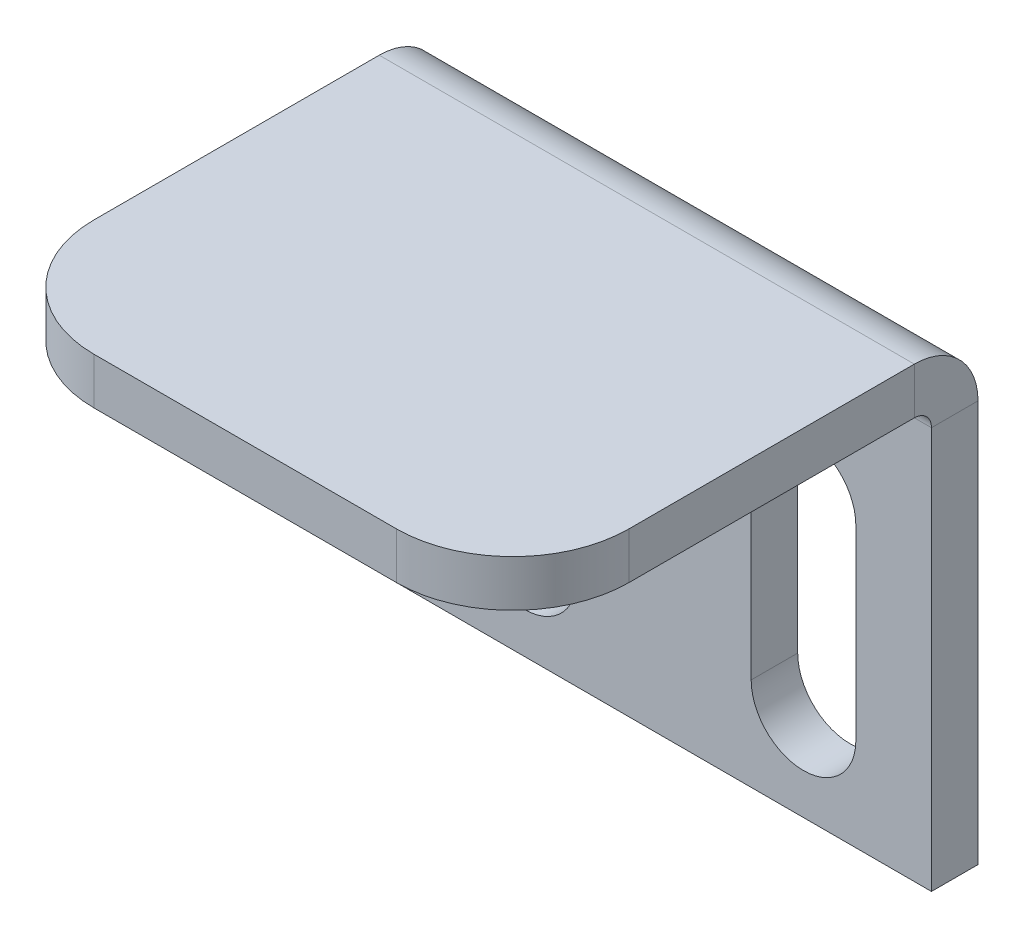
ISO-10303-21;
HEADER;
FILE_DESCRIPTION(('STEP AP214'),'2;1');
FILE_NAME('part.step','',(''),(''),'','','');
FILE_SCHEMA(('AUTOMOTIVE_DESIGN { 1 0 10303 214 1 1 1 1 }'));
ENDSEC;
DATA;
#1=APPLICATION_CONTEXT('core data for automotive mechanical design processes');
#2=APPLICATION_PROTOCOL_DEFINITION('international standard','automotive_design',2000,#1);
#3=PRODUCT_CONTEXT('',#1,'mechanical');
#4=PRODUCT('Part','Part','',(#3));
#5=PRODUCT_RELATED_PRODUCT_CATEGORY('part','',(#4));
#6=PRODUCT_DEFINITION_FORMATION('','',#4);
#7=PRODUCT_DEFINITION_CONTEXT('part definition',#1,'design');
#8=PRODUCT_DEFINITION('design','',#6,#7);
#9=PRODUCT_DEFINITION_SHAPE('','',#8);
#10=(LENGTH_UNIT() NAMED_UNIT(*) SI_UNIT(.MILLI.,.METRE.));
#11=(NAMED_UNIT(*) PLANE_ANGLE_UNIT() SI_UNIT($,.RADIAN.));
#12=(NAMED_UNIT(*) SI_UNIT($,.STERADIAN.) SOLID_ANGLE_UNIT());
#13=UNCERTAINTY_MEASURE_WITH_UNIT(LENGTH_MEASURE(1.E-05),#10,'distance_accuracy_value','');
#14=(GEOMETRIC_REPRESENTATION_CONTEXT(3) GLOBAL_UNCERTAINTY_ASSIGNED_CONTEXT((#13)) GLOBAL_UNIT_ASSIGNED_CONTEXT((#10,
#11,#12)) REPRESENTATION_CONTEXT('',''));
#15=CARTESIAN_POINT('',(0.,0.,0.));
#16=DIRECTION('',(0.,0.,1.));
#17=DIRECTION('',(1.,0.,0.));
#18=AXIS2_PLACEMENT_3D('',#15,#16,#17);
#19=CARTESIAN_POINT('',(-95.0000000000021,-1.16947700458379E-12,2.));
#20=DIRECTION('',(-1.,0.,0.));
#21=DIRECTION('',(0.,0.,1.));
#22=AXIS2_PLACEMENT_3D('',#19,#20,#21);
#23=PLANE('',#22);
#24=DIRECTION('',(0.,0.,-1.));
#25=VECTOR('',#24,1.);
#26=CARTESIAN_POINT('',(-95.0000000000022,-2.73660000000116,2.));
#27=LINE('',#26,#25);
#28=CARTESIAN_POINT('',(-95.0000000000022,-2.73660000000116,2.));
#29=VERTEX_POINT('',#28);
#30=CARTESIAN_POINT('',(-95.0000000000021,-2.73660000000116,0.));
#31=VERTEX_POINT('',#30);
#32=EDGE_CURVE('E259',#29,#31,#27,.T.);
#33=ORIENTED_EDGE('',*,*,#32,.F.);
#34=DIRECTION('',(0.,1.,0.));
#35=VECTOR('',#34,1.);
#36=CARTESIAN_POINT('',(-95.0000000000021,-1.16947700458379E-12,2.));
#37=LINE('',#36,#35);
#38=CARTESIAN_POINT('',(-95.0000000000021,-20.0000000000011,2.));
#39=VERTEX_POINT('',#38);
#40=EDGE_CURVE('E265',#39,#29,#37,.T.);
#41=ORIENTED_EDGE('',*,*,#40,.F.);
#42=DIRECTION('',(0.,0.,-1.));
#43=VECTOR('',#42,1.);
#44=CARTESIAN_POINT('',(-95.0000000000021,-20.0000000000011,2.));
#45=LINE('',#44,#43);
#46=CARTESIAN_POINT('',(-95.0000000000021,-20.0000000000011,0.));
#47=VERTEX_POINT('',#46);
#48=EDGE_CURVE('E273',#39,#47,#45,.T.);
#49=ORIENTED_EDGE('',*,*,#48,.T.);
#50=DIRECTION('',(0.,1.,0.));
#51=VECTOR('',#50,1.);
#52=CARTESIAN_POINT('',(-95.0000000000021,-1.16947700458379E-12,0.));
#53=LINE('',#52,#51);
#54=EDGE_CURVE('E262',#47,#31,#53,.T.);
#55=ORIENTED_EDGE('',*,*,#54,.T.);
#56=EDGE_LOOP('',(#33,#41,#49,#55));
#57=FACE_BOUND('',#56,.T.);
#58=ADVANCED_FACE('F16',(#57),#23,.F.);
#59=CARTESIAN_POINT('',(-118.,0.,2.));
#60=DIRECTION('',(1.,0.,0.));
#61=DIRECTION('',(0.,0.,-1.));
#62=AXIS2_PLACEMENT_3D('',#59,#60,#61);
#63=PLANE('',#62);
#64=DIRECTION('',(0.,0.,-1.));
#65=VECTOR('',#64,1.);
#66=CARTESIAN_POINT('',(-118.,-2.7366,2.));
#67=LINE('',#66,#65);
#68=CARTESIAN_POINT('',(-118.,-2.7366,2.));
#69=VERTEX_POINT('',#68);
#70=CARTESIAN_POINT('',(-118.,-2.7366,0.));
#71=VERTEX_POINT('',#70);
#72=EDGE_CURVE('E249',#69,#71,#67,.T.);
#73=ORIENTED_EDGE('',*,*,#72,.T.);
#74=DIRECTION('',(0.,-1.,0.));
#75=VECTOR('',#74,1.);
#76=CARTESIAN_POINT('',(-118.,0.,0.));
#77=LINE('',#76,#75);
#78=CARTESIAN_POINT('',(-118.,-20.0000000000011,0.));
#79=VERTEX_POINT('',#78);
#80=EDGE_CURVE('E276',#71,#79,#77,.T.);
#81=ORIENTED_EDGE('',*,*,#80,.T.);
#82=DIRECTION('',(0.,0.,-1.));
#83=VECTOR('',#82,1.);
#84=CARTESIAN_POINT('',(-118.,-20.0000000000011,2.));
#85=LINE('',#84,#83);
#86=CARTESIAN_POINT('',(-118.,-20.0000000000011,2.));
#87=VERTEX_POINT('',#86);
#88=EDGE_CURVE('E281',#87,#79,#85,.T.);
#89=ORIENTED_EDGE('',*,*,#88,.F.);
#90=DIRECTION('',(0.,-1.,0.));
#91=VECTOR('',#90,1.);
#92=CARTESIAN_POINT('',(-118.,0.,2.));
#93=LINE('',#92,#91);
#94=EDGE_CURVE('E268',#69,#87,#93,.T.);
#95=ORIENTED_EDGE('',*,*,#94,.F.);
#96=EDGE_LOOP('',(#73,#81,#89,#95));
#97=FACE_BOUND('',#96,.T.);
#98=ADVANCED_FACE('F341',(#97),#63,.F.);
#99=CARTESIAN_POINT('',(0.,0.,2.));
#100=DIRECTION('',(0.,0.,-1.));
#101=DIRECTION('',(-1.,0.,0.));
#102=AXIS2_PLACEMENT_3D('',#99,#100,#101);
#103=PLANE('',#102);
#104=DIRECTION('',(0.,1.,0.));
#105=VECTOR('',#104,1.);
#106=CARTESIAN_POINT('',(-98.2500000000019,-16.0000000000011,2.));
#107=LINE('',#106,#105);
#108=CARTESIAN_POINT('',(-98.2500000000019,-16.0000000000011,2.));
#109=VERTEX_POINT('',#108);
#110=CARTESIAN_POINT('',(-98.2500000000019,-8.00000000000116,2.));
#111=VERTEX_POINT('',#110);
#112=EDGE_CURVE('E177',#109,#111,#107,.T.);
#113=ORIENTED_EDGE('',*,*,#112,.F.);
#114=CARTESIAN_POINT('',(-100.500000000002,-16.0000000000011,2.));
#115=DIRECTION('',(0.,0.,1.));
#116=DIRECTION('',(-1.,0.,0.));
#117=AXIS2_PLACEMENT_3D('',#114,#115,#116);
#118=CIRCLE('',#117,2.25);
#119=CARTESIAN_POINT('',(-102.750000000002,-16.0000000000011,2.));
#120=VERTEX_POINT('',#119);
#121=EDGE_CURVE('E150',#120,#109,#118,.T.);
#122=ORIENTED_EDGE('',*,*,#121,.F.);
#123=DIRECTION('',(0.,-1.,0.));
#124=VECTOR('',#123,1.);
#125=CARTESIAN_POINT('',(-102.750000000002,-16.0000000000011,2.));
#126=LINE('',#125,#124);
#127=CARTESIAN_POINT('',(-102.750000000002,-8.00000000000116,2.));
#128=VERTEX_POINT('',#127);
#129=EDGE_CURVE('E168',#128,#120,#126,.T.);
#130=ORIENTED_EDGE('',*,*,#129,.F.);
#131=CARTESIAN_POINT('',(-100.500000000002,-8.00000000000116,2.));
#132=DIRECTION('',(0.,0.,1.));
#133=DIRECTION('',(-1.,0.,0.));
#134=AXIS2_PLACEMENT_3D('',#131,#132,#133);
#135=CIRCLE('',#134,2.25);
#136=EDGE_CURVE('E171',#111,#128,#135,.T.);
#137=ORIENTED_EDGE('',*,*,#136,.F.);
#138=EDGE_LOOP('',(#113,#122,#130,#137));
#139=FACE_BOUND('',#138,.T.);
#140=DIRECTION('',(0.,1.,0.));
#141=VECTOR('',#140,1.);
#142=CARTESIAN_POINT('',(-110.25,-16.0000000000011,2.));
#143=LINE('',#142,#141);
#144=CARTESIAN_POINT('',(-110.25,-16.0000000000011,2.));
#145=VERTEX_POINT('',#144);
#146=CARTESIAN_POINT('',(-110.25,-8.00000000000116,2.));
#147=VERTEX_POINT('',#146);
#148=EDGE_CURVE('E202',#145,#147,#143,.T.);
#149=ORIENTED_EDGE('',*,*,#148,.F.);
#150=CARTESIAN_POINT('',(-112.5,-16.0000000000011,2.));
#151=DIRECTION('',(0.,0.,1.));
#152=DIRECTION('',(1.,0.,0.));
#153=AXIS2_PLACEMENT_3D('',#150,#151,#152);
#154=CIRCLE('',#153,2.25);
#155=CARTESIAN_POINT('',(-114.75,-16.0000000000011,2.));
#156=VERTEX_POINT('',#155);
#157=EDGE_CURVE('E183',#156,#145,#154,.T.);
#158=ORIENTED_EDGE('',*,*,#157,.F.);
#159=DIRECTION('',(0.,-1.,0.));
#160=VECTOR('',#159,1.);
#161=CARTESIAN_POINT('',(-114.75,-16.0000000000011,2.));
#162=LINE('',#161,#160);
#163=CARTESIAN_POINT('',(-114.75,-8.00000000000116,2.));
#164=VERTEX_POINT('',#163);
#165=EDGE_CURVE('E191',#164,#156,#162,.T.);
#166=ORIENTED_EDGE('',*,*,#165,.F.);
#167=CARTESIAN_POINT('',(-112.5,-8.00000000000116,2.));
#168=DIRECTION('',(0.,0.,1.));
#169=DIRECTION('',(1.,0.,0.));
#170=AXIS2_PLACEMENT_3D('',#167,#168,#169);
#171=CIRCLE('',#170,2.25);
#172=EDGE_CURVE('E205',#147,#164,#171,.T.);
#173=ORIENTED_EDGE('',*,*,#172,.F.);
#174=EDGE_LOOP('',(#149,#158,#166,#173));
#175=FACE_BOUND('',#174,.T.);
#176=DIRECTION('',(-1.,0.,0.));
#177=VECTOR('',#176,1.);
#178=CARTESIAN_POINT('',(-118.,-2.7366,2.));
#179=LINE('',#178,#177);
#180=EDGE_CURVE('E255',#69,#29,#179,.F.);
#181=ORIENTED_EDGE('',*,*,#180,.F.);
#182=ORIENTED_EDGE('',*,*,#94,.T.);
#183=DIRECTION('',(1.,0.,0.));
#184=VECTOR('',#183,1.);
#185=CARTESIAN_POINT('',(-95.0000000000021,-20.0000000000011,2.));
#186=LINE('',#185,#184);
#187=EDGE_CURVE('E271',#87,#39,#186,.T.);
#188=ORIENTED_EDGE('',*,*,#187,.T.);
#189=ORIENTED_EDGE('',*,*,#40,.T.);
#190=EDGE_LOOP('',(#181,#182,#188,#189));
#191=FACE_BOUND('',#190,.T.);
#192=ADVANCED_FACE('F346',(#139,#175,#191),#103,.F.);
#193=CARTESIAN_POINT('',(0.,0.,0.));
#194=DIRECTION('',(0.,0.,-1.));
#195=DIRECTION('',(-1.,0.,0.));
#196=AXIS2_PLACEMENT_3D('',#193,#194,#195);
#197=PLANE('',#196);
#198=CARTESIAN_POINT('',(-100.500000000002,-16.0000000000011,0.));
#199=DIRECTION('',(0.,0.,1.));
#200=DIRECTION('',(-1.,0.,0.));
#201=AXIS2_PLACEMENT_3D('',#198,#199,#200);
#202=CIRCLE('',#201,2.25);
#203=CARTESIAN_POINT('',(-102.750000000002,-16.0000000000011,0.));
#204=VERTEX_POINT('',#203);
#205=CARTESIAN_POINT('',(-98.2500000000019,-16.0000000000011,0.));
#206=VERTEX_POINT('',#205);
#207=EDGE_CURVE('E147',#204,#206,#202,.T.);
#208=ORIENTED_EDGE('',*,*,#207,.T.);
#209=DIRECTION('',(0.,1.,0.));
#210=VECTOR('',#209,1.);
#211=CARTESIAN_POINT('',(-98.2500000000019,-16.0000000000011,0.));
#212=LINE('',#211,#210);
#213=CARTESIAN_POINT('',(-98.2500000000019,-8.00000000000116,0.));
#214=VERTEX_POINT('',#213);
#215=EDGE_CURVE('E159',#206,#214,#212,.T.);
#216=ORIENTED_EDGE('',*,*,#215,.T.);
#217=CARTESIAN_POINT('',(-100.500000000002,-8.00000000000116,0.));
#218=DIRECTION('',(0.,0.,1.));
#219=DIRECTION('',(-1.,0.,0.));
#220=AXIS2_PLACEMENT_3D('',#217,#218,#219);
#221=CIRCLE('',#220,2.25);
#222=CARTESIAN_POINT('',(-102.750000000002,-8.00000000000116,0.));
#223=VERTEX_POINT('',#222);
#224=EDGE_CURVE('E163',#214,#223,#221,.T.);
#225=ORIENTED_EDGE('',*,*,#224,.T.);
#226=DIRECTION('',(0.,-1.,0.));
#227=VECTOR('',#226,1.);
#228=CARTESIAN_POINT('',(-102.750000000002,-16.0000000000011,0.));
#229=LINE('',#228,#227);
#230=EDGE_CURVE('E155',#223,#204,#229,.T.);
#231=ORIENTED_EDGE('',*,*,#230,.T.);
#232=EDGE_LOOP('',(#208,#216,#225,#231));
#233=FACE_BOUND('',#232,.T.);
#234=CARTESIAN_POINT('',(-112.5,-16.0000000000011,0.));
#235=DIRECTION('',(0.,0.,1.));
#236=DIRECTION('',(1.,0.,0.));
#237=AXIS2_PLACEMENT_3D('',#234,#235,#236);
#238=CIRCLE('',#237,2.25);
#239=CARTESIAN_POINT('',(-114.75,-16.0000000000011,0.));
#240=VERTEX_POINT('',#239);
#241=CARTESIAN_POINT('',(-110.25,-16.0000000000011,0.));
#242=VERTEX_POINT('',#241);
#243=EDGE_CURVE('E187',#240,#242,#238,.T.);
#244=ORIENTED_EDGE('',*,*,#243,.T.);
#245=DIRECTION('',(0.,1.,0.));
#246=VECTOR('',#245,1.);
#247=CARTESIAN_POINT('',(-110.25,-16.0000000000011,0.));
#248=LINE('',#247,#246);
#249=CARTESIAN_POINT('',(-110.25,-8.00000000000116,0.));
#250=VERTEX_POINT('',#249);
#251=EDGE_CURVE('E190',#242,#250,#248,.T.);
#252=ORIENTED_EDGE('',*,*,#251,.T.);
#253=CARTESIAN_POINT('',(-112.5,-8.00000000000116,0.));
#254=DIRECTION('',(0.,0.,1.));
#255=DIRECTION('',(1.,0.,0.));
#256=AXIS2_PLACEMENT_3D('',#253,#254,#255);
#257=CIRCLE('',#256,2.25);
#258=CARTESIAN_POINT('',(-114.75,-8.00000000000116,0.));
#259=VERTEX_POINT('',#258);
#260=EDGE_CURVE('E194',#250,#259,#257,.T.);
#261=ORIENTED_EDGE('',*,*,#260,.T.);
#262=DIRECTION('',(0.,-1.,0.));
#263=VECTOR('',#262,1.);
#264=CARTESIAN_POINT('',(-114.75,-16.0000000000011,0.));
#265=LINE('',#264,#263);
#266=EDGE_CURVE('E197',#259,#240,#265,.T.);
#267=ORIENTED_EDGE('',*,*,#266,.T.);
#268=EDGE_LOOP('',(#244,#252,#261,#267));
#269=FACE_BOUND('',#268,.T.);
#270=ORIENTED_EDGE('',*,*,#80,.F.);
#271=DIRECTION('',(-1.,0.,0.));
#272=VECTOR('',#271,1.);
#273=CARTESIAN_POINT('',(-118.,-2.7366,0.));
#274=LINE('',#273,#272);
#275=EDGE_CURVE('E242',#71,#31,#274,.F.);
#276=ORIENTED_EDGE('',*,*,#275,.T.);
#277=ORIENTED_EDGE('',*,*,#54,.F.);
#278=DIRECTION('',(1.,0.,0.));
#279=VECTOR('',#278,1.);
#280=CARTESIAN_POINT('',(-95.0000000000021,-20.0000000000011,0.));
#281=LINE('',#280,#279);
#282=EDGE_CURVE('E269',#79,#47,#281,.T.);
#283=ORIENTED_EDGE('',*,*,#282,.F.);
#284=EDGE_LOOP('',(#270,#276,#277,#283));
#285=FACE_BOUND('',#284,.T.);
#286=ADVANCED_FACE('F165',(#233,#269,#285),#197,.T.);
#287=CARTESIAN_POINT('',(-95.0000000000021,-20.0000000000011,2.));
#288=DIRECTION('',(0.,1.,0.));
#289=DIRECTION('',(-1.,0.,0.));
#290=AXIS2_PLACEMENT_3D('',#287,#288,#289);
#291=PLANE('',#290);
#292=ORIENTED_EDGE('',*,*,#282,.T.);
#293=ORIENTED_EDGE('',*,*,#48,.F.);
#294=ORIENTED_EDGE('',*,*,#187,.F.);
#295=ORIENTED_EDGE('',*,*,#88,.T.);
#296=EDGE_LOOP('',(#292,#293,#294,#295));
#297=FACE_BOUND('',#296,.T.);
#298=ADVANCED_FACE('F337',(#297),#291,.F.);
#299=CARTESIAN_POINT('',(-95.0000000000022,-2.73660000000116,2.7366));
#300=DIRECTION('',(1.,0.,0.));
#301=DIRECTION('',(0.,1.,0.));
#302=AXIS2_PLACEMENT_3D('',#299,#300,#301);
#303=PLANE('',#302);
#304=DIRECTION('',(0.,-1.,0.));
#305=VECTOR('',#304,1.);
#306=CARTESIAN_POINT('',(-95.0000000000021,-1.16706547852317E-12,2.7366));
#307=LINE('',#306,#305);
#308=CARTESIAN_POINT('',(-95.0000000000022,-2.00000000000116,2.7366));
#309=VERTEX_POINT('',#308);
#310=CARTESIAN_POINT('',(-95.0000000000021,-1.1666015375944E-12,2.7366));
#311=VERTEX_POINT('',#310);
#312=EDGE_CURVE('E212',#309,#311,#307,.F.);
#313=ORIENTED_EDGE('',*,*,#312,.F.);
#314=CARTESIAN_POINT('',(-95.0000000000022,-2.73660000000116,2.7366));
#315=DIRECTION('',(-1.,0.,0.));
#316=DIRECTION('',(0.,-1.,0.));
#317=AXIS2_PLACEMENT_3D('',#314,#315,#316);
#318=CIRCLE('',#317,0.7366);
#319=EDGE_CURVE('E252',#29,#309,#318,.F.);
#320=ORIENTED_EDGE('',*,*,#319,.F.);
#321=ORIENTED_EDGE('',*,*,#32,.T.);
#322=CARTESIAN_POINT('',(-95.0000000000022,-2.73660000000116,2.7366));
#323=DIRECTION('',(-1.,0.,0.));
#324=DIRECTION('',(0.,-1.,0.));
#325=AXIS2_PLACEMENT_3D('',#322,#323,#324);
#326=CIRCLE('',#325,2.7366);
#327=EDGE_CURVE('E245',#31,#311,#326,.F.);
#328=ORIENTED_EDGE('',*,*,#327,.T.);
#329=EDGE_LOOP('',(#313,#320,#321,#328));
#330=FACE_BOUND('',#329,.T.);
#331=ADVANCED_FACE('F325',(#330),#303,.T.);
#332=CARTESIAN_POINT('',(-118.,-2.7366,2.7366));
#333=DIRECTION('',(1.,0.,0.));
#334=DIRECTION('',(0.,1.,0.));
#335=AXIS2_PLACEMENT_3D('',#332,#333,#334);
#336=PLANE('',#335);
#337=CARTESIAN_POINT('',(-118.,-2.7366,2.7366));
#338=DIRECTION('',(-1.,0.,0.));
#339=DIRECTION('',(0.,-1.,0.));
#340=AXIS2_PLACEMENT_3D('',#337,#338,#339);
#341=CIRCLE('',#340,0.7366);
#342=CARTESIAN_POINT('',(-118.,-2.,2.7366));
#343=VERTEX_POINT('',#342);
#344=EDGE_CURVE('E221',#343,#69,#341,.T.);
#345=ORIENTED_EDGE('',*,*,#344,.F.);
#346=DIRECTION('',(0.,-1.,0.));
#347=VECTOR('',#346,1.);
#348=CARTESIAN_POINT('',(-118.,-2.,2.7366));
#349=LINE('',#348,#347);
#350=CARTESIAN_POINT('',(-118.,0.,2.7366));
#351=VERTEX_POINT('',#350);
#352=EDGE_CURVE('E235',#343,#351,#349,.F.);
#353=ORIENTED_EDGE('',*,*,#352,.T.);
#354=CARTESIAN_POINT('',(-118.,-2.7366,2.7366));
#355=DIRECTION('',(-1.,0.,0.));
#356=DIRECTION('',(0.,-1.,0.));
#357=AXIS2_PLACEMENT_3D('',#354,#355,#356);
#358=CIRCLE('',#357,2.7366);
#359=EDGE_CURVE('E246',#351,#71,#358,.T.);
#360=ORIENTED_EDGE('',*,*,#359,.T.);
#361=ORIENTED_EDGE('',*,*,#72,.F.);
#362=EDGE_LOOP('',(#345,#353,#360,#361));
#363=FACE_BOUND('',#362,.T.);
#364=ADVANCED_FACE('F321',(#363),#336,.F.);
#365=CARTESIAN_POINT('',(-118.,-2.7366,2.7366));
#366=DIRECTION('',(-1.,0.,0.));
#367=DIRECTION('',(0.,1.,0.));
#368=AXIS2_PLACEMENT_3D('',#365,#366,#367);
#369=CYLINDRICAL_SURFACE('',#368,2.7366);
#370=ORIENTED_EDGE('',*,*,#275,.F.);
#371=ORIENTED_EDGE('',*,*,#359,.F.);
#372=DIRECTION('',(-1.,0.,0.));
#373=VECTOR('',#372,1.);
#374=CARTESIAN_POINT('',(-95.0000000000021,-1.1670352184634E-12,2.7366));
#375=LINE('',#374,#373);
#376=EDGE_CURVE('E232',#351,#311,#375,.F.);
#377=ORIENTED_EDGE('',*,*,#376,.T.);
#378=ORIENTED_EDGE('',*,*,#327,.F.);
#379=EDGE_LOOP('',(#370,#371,#377,#378));
#380=FACE_BOUND('',#379,.T.);
#381=ADVANCED_FACE('F323',(#380),#369,.T.);
#382=CARTESIAN_POINT('',(-118.,-2.7366,2.7366));
#383=DIRECTION('',(-1.,0.,0.));
#384=DIRECTION('',(0.,1.,0.));
#385=AXIS2_PLACEMENT_3D('',#382,#383,#384);
#386=CYLINDRICAL_SURFACE('',#385,0.7366);
#387=ORIENTED_EDGE('',*,*,#180,.T.);
#388=ORIENTED_EDGE('',*,*,#319,.T.);
#389=DIRECTION('',(-1.,0.,0.));
#390=VECTOR('',#389,1.);
#391=CARTESIAN_POINT('',(-95.0000000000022,-2.00000000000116,2.7366));
#392=LINE('',#391,#390);
#393=EDGE_CURVE('E238',#309,#343,#392,.T.);
#394=ORIENTED_EDGE('',*,*,#393,.T.);
#395=ORIENTED_EDGE('',*,*,#344,.T.);
#396=EDGE_LOOP('',(#387,#388,#394,#395));
#397=FACE_BOUND('',#396,.T.);
#398=ADVANCED_FACE('F344',(#397),#386,.F.);
#399=CARTESIAN_POINT('',(-118.,0.,20.));
#400=DIRECTION('',(1.,0.,0.));
#401=DIRECTION('',(0.,1.,0.));
#402=AXIS2_PLACEMENT_3D('',#399,#400,#401);
#403=PLANE('',#402);
#404=DIRECTION('',(0.,0.,-1.));
#405=VECTOR('',#404,1.);
#406=CARTESIAN_POINT('',(-118.,-1.99999999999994,20.));
#407=LINE('',#406,#405);
#408=CARTESIAN_POINT('',(-118.,-1.99999999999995,15.));
#409=VERTEX_POINT('',#408);
#410=EDGE_CURVE('E230',#343,#409,#407,.F.);
#411=ORIENTED_EDGE('',*,*,#410,.T.);
#412=DIRECTION('',(0.,-1.,0.));
#413=VECTOR('',#412,1.);
#414=CARTESIAN_POINT('',(-118.,0.,15.));
#415=LINE('',#414,#413);
#416=CARTESIAN_POINT('',(-118.,0.,15.));
#417=VERTEX_POINT('',#416);
#418=EDGE_CURVE('E11',#409,#417,#415,.F.);
#419=ORIENTED_EDGE('',*,*,#418,.T.);
#420=DIRECTION('',(0.,0.,1.));
#421=VECTOR('',#420,1.);
#422=CARTESIAN_POINT('',(-118.,0.,0.));
#423=LINE('',#422,#421);
#424=EDGE_CURVE('E224',#351,#417,#423,.T.);
#425=ORIENTED_EDGE('',*,*,#424,.F.);
#426=ORIENTED_EDGE('',*,*,#352,.F.);
#427=EDGE_LOOP('',(#411,#419,#425,#426));
#428=FACE_BOUND('',#427,.T.);
#429=ADVANCED_FACE('F318',(#428),#403,.F.);
#430=CARTESIAN_POINT('',(-95.0000000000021,-1.16963730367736E-12,2.));
#431=DIRECTION('',(-1.,0.,0.));
#432=DIRECTION('',(0.,-1.,0.));
#433=AXIS2_PLACEMENT_3D('',#430,#431,#432);
#434=PLANE('',#433);
#435=DIRECTION('',(0.,0.,-1.));
#436=VECTOR('',#435,1.);
#437=CARTESIAN_POINT('',(-95.0000000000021,-1.17638998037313E-12,0.));
#438=LINE('',#437,#436);
#439=CARTESIAN_POINT('',(-95.0000000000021,-1.12401776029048E-12,15.));
#440=VERTEX_POINT('',#439);
#441=EDGE_CURVE('E219',#440,#311,#438,.T.);
#442=ORIENTED_EDGE('',*,*,#441,.F.);
#443=DIRECTION('',(0.,-1.,0.));
#444=VECTOR('',#443,1.);
#445=CARTESIAN_POINT('',(-95.0000000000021,-1.1242480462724E-12,15.));
#446=LINE('',#445,#444);
#447=CARTESIAN_POINT('',(-95.0000000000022,-2.00000000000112,15.));
#448=VERTEX_POINT('',#447);
#449=EDGE_CURVE('E284',#440,#448,#446,.T.);
#450=ORIENTED_EDGE('',*,*,#449,.T.);
#451=DIRECTION('',(0.,0.,1.));
#452=VECTOR('',#451,1.);
#453=CARTESIAN_POINT('',(-95.0000000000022,-2.00000000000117,2.));
#454=LINE('',#453,#452);
#455=EDGE_CURVE('E226',#448,#309,#454,.F.);
#456=ORIENTED_EDGE('',*,*,#455,.T.);
#457=ORIENTED_EDGE('',*,*,#312,.T.);
#458=EDGE_LOOP('',(#442,#450,#456,#457));
#459=FACE_BOUND('',#458,.T.);
#460=ADVANCED_FACE('F304',(#459),#434,.F.);
#461=CARTESIAN_POINT('',(0.,-5.99520433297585E-12,0.));
#462=DIRECTION('',(0.,-1.,0.));
#463=DIRECTION('',(1.,0.,0.));
#464=AXIS2_PLACEMENT_3D('',#461,#462,#463);
#465=PLANE('',#464);
#466=DIRECTION('',(1.,0.,0.));
#467=VECTOR('',#466,1.);
#468=CARTESIAN_POINT('',(0.,-5.92537470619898E-12,20.));
#469=LINE('',#468,#467);
#470=CARTESIAN_POINT('',(-113.,-1.93521844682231E-13,20.));
#471=VERTEX_POINT('',#470);
#472=CARTESIAN_POINT('',(-100.000000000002,-8.52938545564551E-13,20.));
#473=VERTEX_POINT('',#472);
#474=EDGE_CURVE('E222',#471,#473,#469,.T.);
#475=ORIENTED_EDGE('',*,*,#474,.T.);
#476=CARTESIAN_POINT('',(-100.000000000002,-8.70395952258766E-13,15.));
#477=DIRECTION('',(0.,-1.,0.));
#478=DIRECTION('',(1.,0.,0.));
#479=AXIS2_PLACEMENT_3D('',#476,#477,#478);
#480=CIRCLE('',#479,5.);
#481=EDGE_CURVE('E24',#473,#440,#480,.F.);
#482=ORIENTED_EDGE('',*,*,#481,.T.);
#483=ORIENTED_EDGE('',*,*,#441,.T.);
#484=ORIENTED_EDGE('',*,*,#376,.F.);
#485=ORIENTED_EDGE('',*,*,#424,.T.);
#486=CARTESIAN_POINT('',(-113.,-2.10979251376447E-13,15.));
#487=DIRECTION('',(0.,-1.,0.));
#488=DIRECTION('',(1.,0.,0.));
#489=AXIS2_PLACEMENT_3D('',#486,#487,#488);
#490=CIRCLE('',#489,5.);
#491=EDGE_CURVE('E295',#417,#471,#490,.F.);
#492=ORIENTED_EDGE('',*,*,#491,.T.);
#493=EDGE_LOOP('',(#475,#482,#483,#484,#485,#492));
#494=FACE_BOUND('',#493,.T.);
#495=ADVANCED_FACE('F299',(#494),#465,.F.);
#496=CARTESIAN_POINT('',(-1.01448723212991E-13,-2.000000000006,0.));
#497=DIRECTION('',(0.,-1.,0.));
#498=DIRECTION('',(1.,0.,0.));
#499=AXIS2_PLACEMENT_3D('',#496,#497,#498);
#500=PLANE('',#499);
#501=ORIENTED_EDGE('',*,*,#455,.F.);
#502=CARTESIAN_POINT('',(-100.000000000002,-2.00000000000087,15.));
#503=DIRECTION('',(0.,-1.,0.));
#504=DIRECTION('',(1.,0.,0.));
#505=AXIS2_PLACEMENT_3D('',#502,#503,#504);
#506=CIRCLE('',#505,5.);
#507=CARTESIAN_POINT('',(-100.000000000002,-2.00000000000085,20.));
#508=VERTEX_POINT('',#507);
#509=EDGE_CURVE('E289',#448,#508,#506,.T.);
#510=ORIENTED_EDGE('',*,*,#509,.T.);
#511=DIRECTION('',(-1.,0.,0.));
#512=VECTOR('',#511,1.);
#513=CARTESIAN_POINT('',(-95.0000000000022,-2.0000000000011,20.));
#514=LINE('',#513,#512);
#515=CARTESIAN_POINT('',(-113.,-2.0000000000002,20.));
#516=VERTEX_POINT('',#515);
#517=EDGE_CURVE('E228',#516,#508,#514,.F.);
#518=ORIENTED_EDGE('',*,*,#517,.F.);
#519=CARTESIAN_POINT('',(-113.,-2.00000000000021,15.));
#520=DIRECTION('',(0.,-1.,0.));
#521=DIRECTION('',(1.,0.,0.));
#522=AXIS2_PLACEMENT_3D('',#519,#520,#521);
#523=CIRCLE('',#522,5.);
#524=EDGE_CURVE('E287',#516,#409,#523,.T.);
#525=ORIENTED_EDGE('',*,*,#524,.T.);
#526=ORIENTED_EDGE('',*,*,#410,.F.);
#527=ORIENTED_EDGE('',*,*,#393,.F.);
#528=EDGE_LOOP('',(#501,#510,#518,#525,#526,#527));
#529=FACE_BOUND('',#528,.T.);
#530=ADVANCED_FACE('F310',(#529),#500,.T.);
#531=CARTESIAN_POINT('',(-95.0000000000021,-1.1067535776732E-12,20.));
#532=DIRECTION('',(0.,0.,-1.));
#533=DIRECTION('',(0.,1.,0.));
#534=AXIS2_PLACEMENT_3D('',#531,#532,#533);
#535=PLANE('',#534);
#536=ORIENTED_EDGE('',*,*,#517,.T.);
#537=DIRECTION('',(0.,-1.,0.));
#538=VECTOR('',#537,1.);
#539=CARTESIAN_POINT('',(-100.000000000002,-8.53131769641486E-13,20.));
#540=LINE('',#539,#538);
#541=EDGE_CURVE('E37',#508,#473,#540,.F.);
#542=ORIENTED_EDGE('',*,*,#541,.T.);
#543=ORIENTED_EDGE('',*,*,#474,.F.);
#544=DIRECTION('',(0.,-1.,0.));
#545=VECTOR('',#544,1.);
#546=CARTESIAN_POINT('',(-113.,-1.93715068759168E-13,20.));
#547=LINE('',#546,#545);
#548=EDGE_CURVE('E291',#471,#516,#547,.T.);
#549=ORIENTED_EDGE('',*,*,#548,.T.);
#550=EDGE_LOOP('',(#536,#542,#543,#549));
#551=FACE_BOUND('',#550,.T.);
#552=ADVANCED_FACE('F312',(#551),#535,.F.);
#553=CARTESIAN_POINT('',(-112.5,-16.0000000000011,0.));
#554=DIRECTION('',(0.,0.,1.));
#555=DIRECTION('',(1.,0.,0.));
#556=AXIS2_PLACEMENT_3D('',#553,#554,#555);
#557=CYLINDRICAL_SURFACE('',#556,2.25);
#558=ORIENTED_EDGE('',*,*,#157,.T.);
#559=DIRECTION('',(0.,0.,1.));
#560=VECTOR('',#559,1.);
#561=CARTESIAN_POINT('',(-110.25,-16.0000000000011,0.));
#562=LINE('',#561,#560);
#563=EDGE_CURVE('E200',#242,#145,#562,.T.);
#564=ORIENTED_EDGE('',*,*,#563,.F.);
#565=ORIENTED_EDGE('',*,*,#243,.F.);
#566=DIRECTION('',(0.,0.,1.));
#567=VECTOR('',#566,1.);
#568=CARTESIAN_POINT('',(-114.75,-16.0000000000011,0.));
#569=LINE('',#568,#567);
#570=EDGE_CURVE('E210',#240,#156,#569,.T.);
#571=ORIENTED_EDGE('',*,*,#570,.T.);
#572=EDGE_LOOP('',(#558,#564,#565,#571));
#573=FACE_BOUND('',#572,.T.);
#574=ADVANCED_FACE('F390',(#573),#557,.F.);
#575=CARTESIAN_POINT('',(-114.75,-16.0000000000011,0.));
#576=DIRECTION('',(-1.,0.,0.));
#577=DIRECTION('',(0.,0.,1.));
#578=AXIS2_PLACEMENT_3D('',#575,#576,#577);
#579=PLANE('',#578);
#580=ORIENTED_EDGE('',*,*,#165,.T.);
#581=ORIENTED_EDGE('',*,*,#570,.F.);
#582=ORIENTED_EDGE('',*,*,#266,.F.);
#583=DIRECTION('',(0.,0.,1.));
#584=VECTOR('',#583,1.);
#585=CARTESIAN_POINT('',(-114.75,-8.00000000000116,0.));
#586=LINE('',#585,#584);
#587=EDGE_CURVE('E213',#259,#164,#586,.T.);
#588=ORIENTED_EDGE('',*,*,#587,.T.);
#589=EDGE_LOOP('',(#580,#581,#582,#588));
#590=FACE_BOUND('',#589,.T.);
#591=ADVANCED_FACE('F386',(#590),#579,.F.);
#592=CARTESIAN_POINT('',(-112.5,-8.00000000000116,0.));
#593=DIRECTION('',(0.,0.,1.));
#594=DIRECTION('',(1.,0.,0.));
#595=AXIS2_PLACEMENT_3D('',#592,#593,#594);
#596=CYLINDRICAL_SURFACE('',#595,2.25);
#597=ORIENTED_EDGE('',*,*,#172,.T.);
#598=ORIENTED_EDGE('',*,*,#587,.F.);
#599=ORIENTED_EDGE('',*,*,#260,.F.);
#600=DIRECTION('',(0.,0.,1.));
#601=VECTOR('',#600,1.);
#602=CARTESIAN_POINT('',(-110.25,-8.00000000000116,0.));
#603=LINE('',#602,#601);
#604=EDGE_CURVE('E215',#250,#147,#603,.T.);
#605=ORIENTED_EDGE('',*,*,#604,.T.);
#606=EDGE_LOOP('',(#597,#598,#599,#605));
#607=FACE_BOUND('',#606,.T.);
#608=ADVANCED_FACE('F389',(#607),#596,.F.);
#609=CARTESIAN_POINT('',(-110.25,-16.0000000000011,0.));
#610=DIRECTION('',(1.,0.,0.));
#611=DIRECTION('',(0.,0.,-1.));
#612=AXIS2_PLACEMENT_3D('',#609,#610,#611);
#613=PLANE('',#612);
#614=ORIENTED_EDGE('',*,*,#148,.T.);
#615=ORIENTED_EDGE('',*,*,#604,.F.);
#616=ORIENTED_EDGE('',*,*,#251,.F.);
#617=ORIENTED_EDGE('',*,*,#563,.T.);
#618=EDGE_LOOP('',(#614,#615,#616,#617));
#619=FACE_BOUND('',#618,.T.);
#620=ADVANCED_FACE('F385',(#619),#613,.F.);
#621=CARTESIAN_POINT('',(-100.500000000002,-16.0000000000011,0.));
#622=DIRECTION('',(0.,0.,1.));
#623=DIRECTION('',(1.,0.,0.));
#624=AXIS2_PLACEMENT_3D('',#621,#622,#623);
#625=CYLINDRICAL_SURFACE('',#624,2.25);
#626=ORIENTED_EDGE('',*,*,#121,.T.);
#627=DIRECTION('',(0.,0.,1.));
#628=VECTOR('',#627,1.);
#629=CARTESIAN_POINT('',(-98.2500000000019,-16.0000000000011,0.));
#630=LINE('',#629,#628);
#631=EDGE_CURVE('E143',#206,#109,#630,.T.);
#632=ORIENTED_EDGE('',*,*,#631,.F.);
#633=ORIENTED_EDGE('',*,*,#207,.F.);
#634=DIRECTION('',(0.,0.,1.));
#635=VECTOR('',#634,1.);
#636=CARTESIAN_POINT('',(-102.750000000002,-16.0000000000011,0.));
#637=LINE('',#636,#635);
#638=EDGE_CURVE('E181',#204,#120,#637,.T.);
#639=ORIENTED_EDGE('',*,*,#638,.T.);
#640=EDGE_LOOP('',(#626,#632,#633,#639));
#641=FACE_BOUND('',#640,.T.);
#642=ADVANCED_FACE('F145',(#641),#625,.F.);
#643=CARTESIAN_POINT('',(-102.750000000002,-16.0000000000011,0.));
#644=DIRECTION('',(-1.,0.,0.));
#645=DIRECTION('',(0.,0.,1.));
#646=AXIS2_PLACEMENT_3D('',#643,#644,#645);
#647=PLANE('',#646);
#648=ORIENTED_EDGE('',*,*,#129,.T.);
#649=ORIENTED_EDGE('',*,*,#638,.F.);
#650=ORIENTED_EDGE('',*,*,#230,.F.);
#651=DIRECTION('',(0.,0.,1.));
#652=VECTOR('',#651,1.);
#653=CARTESIAN_POINT('',(-102.750000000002,-8.00000000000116,0.));
#654=LINE('',#653,#652);
#655=EDGE_CURVE('E184',#223,#128,#654,.T.);
#656=ORIENTED_EDGE('',*,*,#655,.T.);
#657=EDGE_LOOP('',(#648,#649,#650,#656));
#658=FACE_BOUND('',#657,.T.);
#659=ADVANCED_FACE('F378',(#658),#647,.F.);
#660=CARTESIAN_POINT('',(-100.500000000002,-8.00000000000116,0.));
#661=DIRECTION('',(0.,0.,1.));
#662=DIRECTION('',(1.,0.,0.));
#663=AXIS2_PLACEMENT_3D('',#660,#661,#662);
#664=CYLINDRICAL_SURFACE('',#663,2.25);
#665=ORIENTED_EDGE('',*,*,#136,.T.);
#666=ORIENTED_EDGE('',*,*,#655,.F.);
#667=ORIENTED_EDGE('',*,*,#224,.F.);
#668=DIRECTION('',(0.,0.,1.));
#669=VECTOR('',#668,1.);
#670=CARTESIAN_POINT('',(-98.2500000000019,-8.00000000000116,0.));
#671=LINE('',#670,#669);
#672=EDGE_CURVE('E154',#214,#111,#671,.T.);
#673=ORIENTED_EDGE('',*,*,#672,.T.);
#674=EDGE_LOOP('',(#665,#666,#667,#673));
#675=FACE_BOUND('',#674,.T.);
#676=ADVANCED_FACE('F372',(#675),#664,.F.);
#677=CARTESIAN_POINT('',(-98.2500000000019,-16.0000000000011,0.));
#678=DIRECTION('',(1.,0.,0.));
#679=DIRECTION('',(0.,0.,-1.));
#680=AXIS2_PLACEMENT_3D('',#677,#678,#679);
#681=PLANE('',#680);
#682=ORIENTED_EDGE('',*,*,#112,.T.);
#683=ORIENTED_EDGE('',*,*,#672,.F.);
#684=ORIENTED_EDGE('',*,*,#215,.F.);
#685=ORIENTED_EDGE('',*,*,#631,.T.);
#686=EDGE_LOOP('',(#682,#683,#684,#685));
#687=FACE_BOUND('',#686,.T.);
#688=ADVANCED_FACE('F160',(#687),#681,.F.);
#689=CARTESIAN_POINT('',(-100.000000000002,-8.70626238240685E-13,15.));
#690=DIRECTION('',(0.,-1.,0.));
#691=DIRECTION('',(1.,0.,0.));
#692=AXIS2_PLACEMENT_3D('',#689,#690,#691);
#693=CYLINDRICAL_SURFACE('',#692,5.);
#694=ORIENTED_EDGE('',*,*,#481,.F.);
#695=ORIENTED_EDGE('',*,*,#541,.F.);
#696=ORIENTED_EDGE('',*,*,#509,.F.);
#697=ORIENTED_EDGE('',*,*,#449,.F.);
#698=EDGE_LOOP('',(#694,#695,#696,#697));
#699=FACE_BOUND('',#698,.T.);
#700=ADVANCED_FACE('F307',(#699),#693,.T.);
#701=CARTESIAN_POINT('',(-113.,-2.11172475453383E-13,15.));
#702=DIRECTION('',(0.,-1.,0.));
#703=DIRECTION('',(1.,0.,0.));
#704=AXIS2_PLACEMENT_3D('',#701,#702,#703);
#705=CYLINDRICAL_SURFACE('',#704,5.);
#706=ORIENTED_EDGE('',*,*,#491,.F.);
#707=ORIENTED_EDGE('',*,*,#418,.F.);
#708=ORIENTED_EDGE('',*,*,#524,.F.);
#709=ORIENTED_EDGE('',*,*,#548,.F.);
#710=EDGE_LOOP('',(#706,#707,#708,#709));
#711=FACE_BOUND('',#710,.T.);
#712=ADVANCED_FACE('F18',(#711),#705,.T.);
#713=CLOSED_SHELL('',(#58,#98,#192,#286,#298,#331,#364,#381,#398,#429,#460,#495,#530,#552,#574,
#591,#608,#620,#642,#659,#676,#688,#700,#712));
#714=MANIFOLD_SOLID_BREP('B1',#713);
#715=ADVANCED_BREP_SHAPE_REPRESENTATION('',(#18,#714),#14);
#716=SHAPE_DEFINITION_REPRESENTATION(#9,#715);
ENDSEC;
END-ISO-10303-21;
